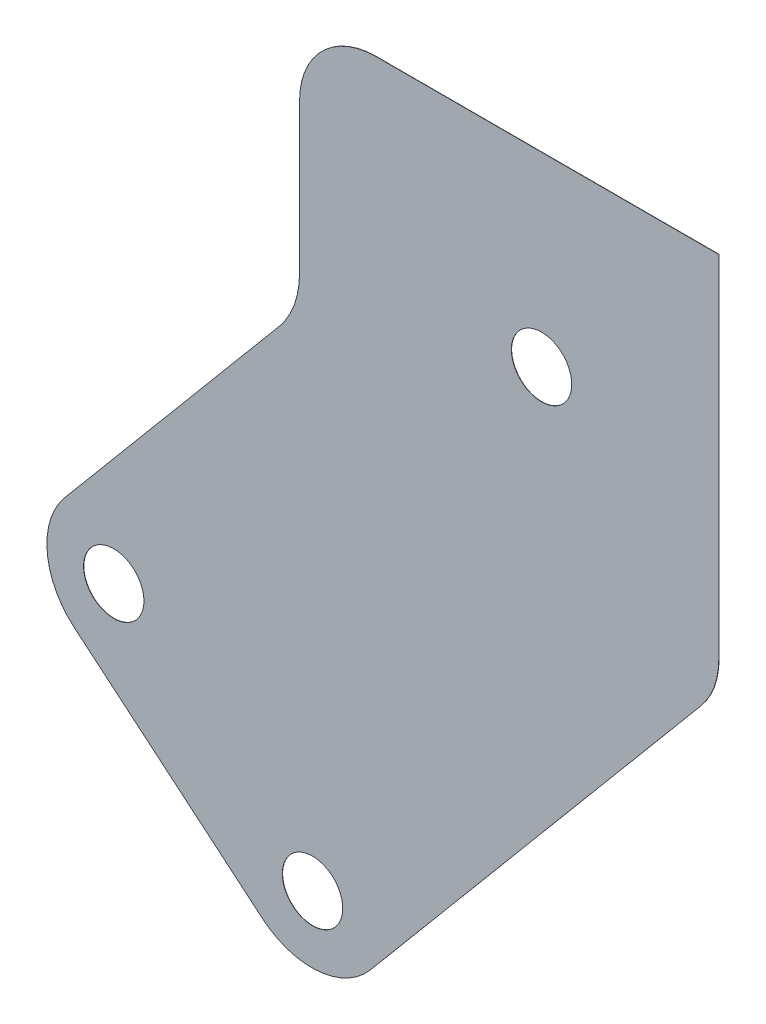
ISO-10303-21;
HEADER;
FILE_DESCRIPTION(('STEP AP214'),'2;1');
FILE_NAME('part.step','',(''),(''),'','','');
FILE_SCHEMA(('AUTOMOTIVE_DESIGN { 1 0 10303 214 1 1 1 1 }'));
ENDSEC;
DATA;
#1=APPLICATION_CONTEXT('core data for automotive mechanical design processes');
#2=APPLICATION_PROTOCOL_DEFINITION('international standard','automotive_design',2000,#1);
#3=PRODUCT_CONTEXT('',#1,'mechanical');
#4=PRODUCT('Part','Part','',(#3));
#5=PRODUCT_RELATED_PRODUCT_CATEGORY('part','',(#4));
#6=PRODUCT_DEFINITION_FORMATION('','',#4);
#7=PRODUCT_DEFINITION_CONTEXT('part definition',#1,'design');
#8=PRODUCT_DEFINITION('design','',#6,#7);
#9=PRODUCT_DEFINITION_SHAPE('','',#8);
#10=(LENGTH_UNIT() NAMED_UNIT(*) SI_UNIT(.MILLI.,.METRE.));
#11=(NAMED_UNIT(*) PLANE_ANGLE_UNIT() SI_UNIT($,.RADIAN.));
#12=(NAMED_UNIT(*) SI_UNIT($,.STERADIAN.) SOLID_ANGLE_UNIT());
#13=UNCERTAINTY_MEASURE_WITH_UNIT(LENGTH_MEASURE(1.E-05),#10,'distance_accuracy_value','');
#14=(GEOMETRIC_REPRESENTATION_CONTEXT(3) GLOBAL_UNCERTAINTY_ASSIGNED_CONTEXT((#13)) GLOBAL_UNIT_ASSIGNED_CONTEXT((#10,
#11,#12)) REPRESENTATION_CONTEXT('',''));
#15=CARTESIAN_POINT('',(0.,0.,0.));
#16=DIRECTION('',(0.,0.,1.));
#17=DIRECTION('',(1.,0.,0.));
#18=AXIS2_PLACEMENT_3D('',#15,#16,#17);
#19=CARTESIAN_POINT('',(-545.839152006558,-46.319640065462,0.0254000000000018));
#20=DIRECTION('',(-1.,0.,0.));
#21=DIRECTION('',(0.,0.,1.));
#22=AXIS2_PLACEMENT_3D('',#19,#20,#21);
#23=PLANE('',#22);
#24=DIRECTION('',(0.,1.,0.));
#25=VECTOR('',#24,1.);
#26=CARTESIAN_POINT('',(-545.839152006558,-46.319640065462,0.));
#27=LINE('',#26,#25);
#28=CARTESIAN_POINT('',(-545.839152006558,-46.319640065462,0.));
#29=VERTEX_POINT('',#28);
#30=CARTESIAN_POINT('',(-545.839152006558,-13.7078728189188,0.));
#31=VERTEX_POINT('',#30);
#32=EDGE_CURVE('E165',#29,#31,#27,.T.);
#33=ORIENTED_EDGE('',*,*,#32,.T.);
#34=DIRECTION('',(0.,0.,-1.));
#35=VECTOR('',#34,1.);
#36=CARTESIAN_POINT('',(-545.839152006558,-13.7078728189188,0.0254000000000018));
#37=LINE('',#36,#35);
#38=CARTESIAN_POINT('',(-545.839152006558,-13.7078728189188,0.0254000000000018));
#39=VERTEX_POINT('',#38);
#40=EDGE_CURVE('E11',#39,#31,#37,.T.);
#41=ORIENTED_EDGE('',*,*,#40,.F.);
#42=DIRECTION('',(0.,1.,0.));
#43=VECTOR('',#42,1.);
#44=CARTESIAN_POINT('',(-545.839152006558,-46.319640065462,0.0254000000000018));
#45=LINE('',#44,#43);
#46=CARTESIAN_POINT('',(-545.839152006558,-46.319640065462,0.0254000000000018));
#47=VERTEX_POINT('',#46);
#48=EDGE_CURVE('E197',#47,#39,#45,.T.);
#49=ORIENTED_EDGE('',*,*,#48,.F.);
#50=DIRECTION('',(0.,0.,-1.));
#51=VECTOR('',#50,1.);
#52=CARTESIAN_POINT('',(-545.839152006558,-46.319640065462,0.0254000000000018));
#53=LINE('',#52,#51);
#54=EDGE_CURVE('E161',#47,#29,#53,.T.);
#55=ORIENTED_EDGE('',*,*,#54,.T.);
#56=EDGE_LOOP('',(#33,#41,#49,#55));
#57=FACE_BOUND('',#56,.T.);
#58=ADVANCED_FACE('F45',(#57),#23,.F.);
#59=CARTESIAN_POINT('',(-545.839152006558,-13.7078728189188,0.0254000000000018));
#60=DIRECTION('',(0.,-1.,0.));
#61=DIRECTION('',(1.,0.,0.));
#62=AXIS2_PLACEMENT_3D('',#59,#60,#61);
#63=PLANE('',#62);
#64=DIRECTION('',(-1.,0.,0.));
#65=VECTOR('',#64,1.);
#66=CARTESIAN_POINT('',(-545.839152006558,-13.7078728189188,0.));
#67=LINE('',#66,#65);
#68=CARTESIAN_POINT('',(-577.716152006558,-13.7078728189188,0.));
#69=VERTEX_POINT('',#68);
#70=EDGE_CURVE('E169',#31,#69,#67,.T.);
#71=ORIENTED_EDGE('',*,*,#70,.T.);
#72=DIRECTION('',(0.,0.,-1.));
#73=VECTOR('',#72,1.);
#74=CARTESIAN_POINT('',(-577.716152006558,-13.7078728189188,0.0254000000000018));
#75=LINE('',#74,#73);
#76=CARTESIAN_POINT('',(-577.716152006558,-13.7078728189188,0.0254000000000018));
#77=VERTEX_POINT('',#76);
#78=EDGE_CURVE('E54',#77,#69,#75,.T.);
#79=ORIENTED_EDGE('',*,*,#78,.F.);
#80=DIRECTION('',(-1.,0.,0.));
#81=VECTOR('',#80,1.);
#82=CARTESIAN_POINT('',(-545.839152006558,-13.7078728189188,0.0254000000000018));
#83=LINE('',#82,#81);
#84=EDGE_CURVE('E114',#39,#77,#83,.T.);
#85=ORIENTED_EDGE('',*,*,#84,.F.);
#86=ORIENTED_EDGE('',*,*,#40,.T.);
#87=EDGE_LOOP('',(#71,#79,#85,#86));
#88=FACE_BOUND('',#87,.T.);
#89=ADVANCED_FACE('F290',(#88),#63,.F.);
#90=CARTESIAN_POINT('',(-577.716152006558,-20.8198728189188,0.0254000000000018));
#91=DIRECTION('',(0.,0.,-1.));
#92=DIRECTION('',(-1.,0.,0.));
#93=AXIS2_PLACEMENT_3D('',#90,#91,#92);
#94=CYLINDRICAL_SURFACE('',#93,7.112);
#95=CARTESIAN_POINT('',(-577.716152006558,-20.8198728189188,0.));
#96=DIRECTION('',(0.,0.,1.));
#97=DIRECTION('',(1.,0.,0.));
#98=AXIS2_PLACEMENT_3D('',#95,#96,#97);
#99=CIRCLE('',#98,7.112);
#100=CARTESIAN_POINT('',(-584.828152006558,-20.8198728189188,0.));
#101=VERTEX_POINT('',#100);
#102=EDGE_CURVE('E173',#69,#101,#99,.T.);
#103=ORIENTED_EDGE('',*,*,#102,.T.);
#104=DIRECTION('',(0.,0.,-1.));
#105=VECTOR('',#104,1.);
#106=CARTESIAN_POINT('',(-584.828152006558,-20.8198728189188,0.0254000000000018));
#107=LINE('',#106,#105);
#108=CARTESIAN_POINT('',(-584.828152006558,-20.8198728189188,0.0254000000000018));
#109=VERTEX_POINT('',#108);
#110=EDGE_CURVE('E220',#109,#101,#107,.T.);
#111=ORIENTED_EDGE('',*,*,#110,.F.);
#112=CARTESIAN_POINT('',(-577.716152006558,-20.8198728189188,0.0254000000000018));
#113=DIRECTION('',(0.,0.,1.));
#114=DIRECTION('',(1.,0.,0.));
#115=AXIS2_PLACEMENT_3D('',#112,#113,#114);
#116=CIRCLE('',#115,7.112);
#117=EDGE_CURVE('E231',#77,#109,#116,.T.);
#118=ORIENTED_EDGE('',*,*,#117,.F.);
#119=ORIENTED_EDGE('',*,*,#78,.T.);
#120=EDGE_LOOP('',(#103,#111,#118,#119));
#121=FACE_BOUND('',#120,.T.);
#122=ADVANCED_FACE('F229',(#121),#94,.T.);
#123=CARTESIAN_POINT('',(-584.828152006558,-20.8198728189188,0.0254000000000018));
#124=DIRECTION('',(1.,0.,0.));
#125=DIRECTION('',(0.,0.,-1.));
#126=AXIS2_PLACEMENT_3D('',#123,#124,#125);
#127=PLANE('',#126);
#128=DIRECTION('',(0.,-1.,0.));
#129=VECTOR('',#128,1.);
#130=CARTESIAN_POINT('',(-584.828152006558,-20.8198728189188,0.));
#131=LINE('',#130,#129);
#132=CARTESIAN_POINT('',(-584.828152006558,-34.722664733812,0.));
#133=VERTEX_POINT('',#132);
#134=EDGE_CURVE('E176',#101,#133,#131,.T.);
#135=ORIENTED_EDGE('',*,*,#134,.T.);
#136=DIRECTION('',(0.,0.,-1.));
#137=VECTOR('',#136,1.);
#138=CARTESIAN_POINT('',(-584.828152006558,-34.722664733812,0.0254000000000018));
#139=LINE('',#138,#137);
#140=CARTESIAN_POINT('',(-584.828152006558,-34.722664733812,0.0254000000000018));
#141=VERTEX_POINT('',#140);
#142=EDGE_CURVE('E216',#141,#133,#139,.T.);
#143=ORIENTED_EDGE('',*,*,#142,.F.);
#144=DIRECTION('',(0.,-1.,0.));
#145=VECTOR('',#144,1.);
#146=CARTESIAN_POINT('',(-584.828152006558,-20.8198728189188,0.0254000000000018));
#147=LINE('',#146,#145);
#148=EDGE_CURVE('E250',#109,#141,#147,.T.);
#149=ORIENTED_EDGE('',*,*,#148,.F.);
#150=ORIENTED_EDGE('',*,*,#110,.T.);
#151=EDGE_LOOP('',(#135,#143,#149,#150));
#152=FACE_BOUND('',#151,.T.);
#153=ADVANCED_FACE('F240',(#152),#127,.F.);
#154=CARTESIAN_POINT('',(-592.956152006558,-34.722664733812,0.0254000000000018));
#155=DIRECTION('',(0.,0.,-1.));
#156=DIRECTION('',(-1.,0.,0.));
#157=AXIS2_PLACEMENT_3D('',#154,#155,#156);
#158=CYLINDRICAL_SURFACE('',#157,8.12799999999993);
#159=CARTESIAN_POINT('',(-592.956152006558,-34.722664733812,0.));
#160=DIRECTION('',(0.,0.,-1.));
#161=DIRECTION('',(1.,0.,0.));
#162=AXIS2_PLACEMENT_3D('',#159,#160,#161);
#163=CIRCLE('',#162,8.12799999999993);
#164=CARTESIAN_POINT('',(-586.729742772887,-39.9472424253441,0.));
#165=VERTEX_POINT('',#164);
#166=EDGE_CURVE('E179',#133,#165,#163,.T.);
#167=ORIENTED_EDGE('',*,*,#166,.T.);
#168=DIRECTION('',(0.,0.,-1.));
#169=VECTOR('',#168,1.);
#170=CARTESIAN_POINT('',(-586.729742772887,-39.9472424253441,0.0254000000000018));
#171=LINE('',#170,#169);
#172=CARTESIAN_POINT('',(-586.729742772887,-39.9472424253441,0.0254000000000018));
#173=VERTEX_POINT('',#172);
#174=EDGE_CURVE('E212',#173,#165,#171,.T.);
#175=ORIENTED_EDGE('',*,*,#174,.F.);
#176=CARTESIAN_POINT('',(-592.956152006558,-34.722664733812,0.0254000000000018));
#177=DIRECTION('',(0.,0.,-1.));
#178=DIRECTION('',(1.,0.,0.));
#179=AXIS2_PLACEMENT_3D('',#176,#177,#178);
#180=CIRCLE('',#179,8.12799999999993);
#181=EDGE_CURVE('E246',#141,#173,#180,.T.);
#182=ORIENTED_EDGE('',*,*,#181,.F.);
#183=ORIENTED_EDGE('',*,*,#142,.T.);
#184=EDGE_LOOP('',(#167,#175,#182,#183));
#185=FACE_BOUND('',#184,.T.);
#186=ADVANCED_FACE('F244',(#185),#158,.F.);
#187=CARTESIAN_POINT('',(-586.729742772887,-39.9472424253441,0.0254000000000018));
#188=DIRECTION('',(0.76604444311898,-0.642787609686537,0.));
#189=DIRECTION('',(0.642787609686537,0.76604444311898,0.));
#190=AXIS2_PLACEMENT_3D('',#187,#188,#189);
#191=PLANE('',#190);
#192=DIRECTION('',(-0.642787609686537,-0.76604444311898,0.));
#193=VECTOR('',#192,1.);
#194=CARTESIAN_POINT('',(-586.729742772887,-39.9472424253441,0.));
#195=LINE('',#194,#193);
#196=CARTESIAN_POINT('',(-606.65926008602,-63.6983162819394,0.));
#197=VERTEX_POINT('',#196);
#198=EDGE_CURVE('E182',#165,#197,#195,.T.);
#199=ORIENTED_EDGE('',*,*,#198,.T.);
#200=DIRECTION('',(0.,0.,-1.));
#201=VECTOR('',#200,1.);
#202=CARTESIAN_POINT('',(-606.65926008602,-63.6983162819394,0.0254000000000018));
#203=LINE('',#202,#201);
#204=CARTESIAN_POINT('',(-606.65926008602,-63.6983162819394,0.0254000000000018));
#205=VERTEX_POINT('',#204);
#206=EDGE_CURVE('E208',#205,#197,#203,.T.);
#207=ORIENTED_EDGE('',*,*,#206,.F.);
#208=DIRECTION('',(-0.642787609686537,-0.76604444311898,0.));
#209=VECTOR('',#208,1.);
#210=CARTESIAN_POINT('',(-586.729742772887,-39.9472424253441,0.0254000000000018));
#211=LINE('',#210,#209);
#212=EDGE_CURVE('E249',#173,#205,#211,.T.);
#213=ORIENTED_EDGE('',*,*,#212,.F.);
#214=ORIENTED_EDGE('',*,*,#174,.T.);
#215=EDGE_LOOP('',(#199,#207,#213,#214));
#216=FACE_BOUND('',#215,.T.);
#217=ADVANCED_FACE('F303',(#216),#191,.F.);
#218=CARTESIAN_POINT('',(-601.211152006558,-68.26982176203,0.0254000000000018));
#219=DIRECTION('',(0.,0.,-1.));
#220=DIRECTION('',(-1.,0.,0.));
#221=AXIS2_PLACEMENT_3D('',#218,#219,#220);
#222=CYLINDRICAL_SURFACE('',#221,7.11200000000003);
#223=CARTESIAN_POINT('',(-601.211152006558,-68.26982176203,0.));
#224=DIRECTION('',(0.,0.,1.));
#225=DIRECTION('',(1.,0.,0.));
#226=AXIS2_PLACEMENT_3D('',#223,#224,#225);
#227=CIRCLE('',#226,7.11200000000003);
#228=CARTESIAN_POINT('',(-605.782657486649,-73.7179298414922,0.));
#229=VERTEX_POINT('',#228);
#230=EDGE_CURVE('E185',#197,#229,#227,.T.);
#231=ORIENTED_EDGE('',*,*,#230,.T.);
#232=DIRECTION('',(0.,0.,-1.));
#233=VECTOR('',#232,1.);
#234=CARTESIAN_POINT('',(-605.782657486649,-73.7179298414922,0.0254000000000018));
#235=LINE('',#234,#233);
#236=CARTESIAN_POINT('',(-605.782657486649,-73.7179298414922,0.0254000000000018));
#237=VERTEX_POINT('',#236);
#238=EDGE_CURVE('E204',#237,#229,#235,.T.);
#239=ORIENTED_EDGE('',*,*,#238,.F.);
#240=CARTESIAN_POINT('',(-601.211152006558,-68.26982176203,0.0254000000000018));
#241=DIRECTION('',(0.,0.,1.));
#242=DIRECTION('',(1.,0.,0.));
#243=AXIS2_PLACEMENT_3D('',#240,#241,#242);
#244=CIRCLE('',#243,7.11200000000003);
#245=EDGE_CURVE('E255',#205,#237,#244,.T.);
#246=ORIENTED_EDGE('',*,*,#245,.F.);
#247=ORIENTED_EDGE('',*,*,#206,.T.);
#248=EDGE_LOOP('',(#231,#239,#246,#247));
#249=FACE_BOUND('',#248,.T.);
#250=ADVANCED_FACE('F270',(#249),#222,.T.);
#251=CARTESIAN_POINT('',(-605.782657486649,-73.7179298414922,0.0254000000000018));
#252=DIRECTION('',(0.64278760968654,0.766044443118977,0.));
#253=DIRECTION('',(-0.766044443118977,0.64278760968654,0.));
#254=AXIS2_PLACEMENT_3D('',#251,#252,#253);
#255=PLANE('',#254);
#256=DIRECTION('',(0.766044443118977,-0.64278760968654,0.));
#257=VECTOR('',#256,1.);
#258=CARTESIAN_POINT('',(-605.782657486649,-73.7179298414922,0.));
#259=LINE('',#258,#257);
#260=CARTESIAN_POINT('',(-588.270881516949,-88.4120545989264,0.));
#261=VERTEX_POINT('',#260);
#262=EDGE_CURVE('E188',#229,#261,#259,.T.);
#263=ORIENTED_EDGE('',*,*,#262,.T.);
#264=DIRECTION('',(0.,0.,-1.));
#265=VECTOR('',#264,1.);
#266=CARTESIAN_POINT('',(-588.270881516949,-88.4120545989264,0.0254000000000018));
#267=LINE('',#266,#265);
#268=CARTESIAN_POINT('',(-588.270881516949,-88.4120545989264,0.0254000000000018));
#269=VERTEX_POINT('',#268);
#270=EDGE_CURVE('E153',#269,#261,#267,.T.);
#271=ORIENTED_EDGE('',*,*,#270,.F.);
#272=DIRECTION('',(0.766044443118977,-0.64278760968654,0.));
#273=VECTOR('',#272,1.);
#274=CARTESIAN_POINT('',(-605.782657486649,-73.7179298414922,0.0254000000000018));
#275=LINE('',#274,#273);
#276=EDGE_CURVE('E142',#237,#269,#275,.T.);
#277=ORIENTED_EDGE('',*,*,#276,.F.);
#278=ORIENTED_EDGE('',*,*,#238,.T.);
#279=EDGE_LOOP('',(#263,#271,#277,#278));
#280=FACE_BOUND('',#279,.T.);
#281=ADVANCED_FACE('F274',(#280),#255,.F.);
#282=CARTESIAN_POINT('',(-583.699376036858,-82.9639465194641,0.0254000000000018));
#283=DIRECTION('',(0.,0.,-1.));
#284=DIRECTION('',(-1.,0.,0.));
#285=AXIS2_PLACEMENT_3D('',#282,#283,#284);
#286=CYLINDRICAL_SURFACE('',#285,7.11200000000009);
#287=CARTESIAN_POINT('',(-583.699376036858,-82.9639465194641,0.));
#288=DIRECTION('',(0.,0.,1.));
#289=DIRECTION('',(1.,0.,0.));
#290=AXIS2_PLACEMENT_3D('',#287,#288,#289);
#291=CIRCLE('',#290,7.11200000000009);
#292=CARTESIAN_POINT('',(-578.251267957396,-87.5354519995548,0.));
#293=VERTEX_POINT('',#292);
#294=EDGE_CURVE('E151',#261,#293,#291,.T.);
#295=ORIENTED_EDGE('',*,*,#294,.T.);
#296=DIRECTION('',(0.,0.,-1.));
#297=VECTOR('',#296,1.);
#298=CARTESIAN_POINT('',(-578.251267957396,-87.5354519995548,0.0254000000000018));
#299=LINE('',#298,#297);
#300=CARTESIAN_POINT('',(-578.251267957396,-87.5354519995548,0.0254000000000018));
#301=VERTEX_POINT('',#300);
#302=EDGE_CURVE('E148',#301,#293,#299,.T.);
#303=ORIENTED_EDGE('',*,*,#302,.F.);
#304=CARTESIAN_POINT('',(-583.699376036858,-82.9639465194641,0.0254000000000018));
#305=DIRECTION('',(0.,0.,1.));
#306=DIRECTION('',(1.,0.,0.));
#307=AXIS2_PLACEMENT_3D('',#304,#305,#306);
#308=CIRCLE('',#307,7.11200000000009);
#309=EDGE_CURVE('E136',#269,#301,#308,.T.);
#310=ORIENTED_EDGE('',*,*,#309,.F.);
#311=ORIENTED_EDGE('',*,*,#270,.T.);
#312=EDGE_LOOP('',(#295,#303,#310,#311));
#313=FACE_BOUND('',#312,.T.);
#314=ADVANCED_FACE('F149',(#313),#286,.T.);
#315=CARTESIAN_POINT('',(-578.251267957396,-87.5354519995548,0.0254000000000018));
#316=DIRECTION('',(-0.766044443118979,0.642787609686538,0.));
#317=DIRECTION('',(-0.642787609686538,-0.766044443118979,0.));
#318=AXIS2_PLACEMENT_3D('',#315,#316,#317);
#319=PLANE('',#318);
#320=DIRECTION('',(0.642787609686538,0.766044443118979,0.));
#321=VECTOR('',#320,1.);
#322=CARTESIAN_POINT('',(-578.251267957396,-87.5354519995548,0.));
#323=LINE('',#322,#321);
#324=CARTESIAN_POINT('',(-547.503043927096,-50.8911455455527,0.));
#325=VERTEX_POINT('',#324);
#326=EDGE_CURVE('E100',#293,#325,#323,.T.);
#327=ORIENTED_EDGE('',*,*,#326,.T.);
#328=DIRECTION('',(0.,0.,-1.));
#329=VECTOR('',#328,1.);
#330=CARTESIAN_POINT('',(-547.503043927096,-50.8911455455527,0.0254000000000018));
#331=LINE('',#330,#329);
#332=CARTESIAN_POINT('',(-547.503043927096,-50.8911455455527,0.0254000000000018));
#333=VERTEX_POINT('',#332);
#334=EDGE_CURVE('E154',#333,#325,#331,.T.);
#335=ORIENTED_EDGE('',*,*,#334,.F.);
#336=DIRECTION('',(0.642787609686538,0.766044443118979,0.));
#337=VECTOR('',#336,1.);
#338=CARTESIAN_POINT('',(-578.251267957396,-87.5354519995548,0.0254000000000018));
#339=LINE('',#338,#337);
#340=EDGE_CURVE('E140',#301,#333,#339,.T.);
#341=ORIENTED_EDGE('',*,*,#340,.F.);
#342=ORIENTED_EDGE('',*,*,#302,.T.);
#343=EDGE_LOOP('',(#327,#335,#341,#342));
#344=FACE_BOUND('',#343,.T.);
#345=ADVANCED_FACE('F156',(#344),#319,.F.);
#346=CARTESIAN_POINT('',(-552.951152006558,-46.319640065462,0.0254000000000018));
#347=DIRECTION('',(0.,0.,-1.));
#348=DIRECTION('',(-1.,0.,0.));
#349=AXIS2_PLACEMENT_3D('',#346,#347,#348);
#350=CYLINDRICAL_SURFACE('',#349,7.11199999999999);
#351=CARTESIAN_POINT('',(-552.951152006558,-46.319640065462,0.));
#352=DIRECTION('',(0.,0.,1.));
#353=DIRECTION('',(1.,0.,0.));
#354=AXIS2_PLACEMENT_3D('',#351,#352,#353);
#355=CIRCLE('',#354,7.11199999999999);
#356=EDGE_CURVE('E106',#325,#29,#355,.T.);
#357=ORIENTED_EDGE('',*,*,#356,.T.);
#358=ORIENTED_EDGE('',*,*,#54,.F.);
#359=CARTESIAN_POINT('',(-552.951152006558,-46.319640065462,0.0254000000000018));
#360=DIRECTION('',(0.,0.,1.));
#361=DIRECTION('',(1.,0.,0.));
#362=AXIS2_PLACEMENT_3D('',#359,#360,#361);
#363=CIRCLE('',#362,7.11199999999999);
#364=EDGE_CURVE('E62',#333,#47,#363,.T.);
#365=ORIENTED_EDGE('',*,*,#364,.F.);
#366=ORIENTED_EDGE('',*,*,#334,.T.);
#367=EDGE_LOOP('',(#357,#358,#365,#366));
#368=FACE_BOUND('',#367,.T.);
#369=ADVANCED_FACE('F278',(#368),#350,.T.);
#370=CARTESIAN_POINT('',(-577.716152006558,-20.8198728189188,0.0254000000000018));
#371=DIRECTION('',(0.,0.,1.));
#372=DIRECTION('',(1.,0.,0.));
#373=AXIS2_PLACEMENT_3D('',#370,#371,#372);
#374=PLANE('',#373);
#375=CARTESIAN_POINT('',(-602.1057603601,-68.3480898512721,0.0254000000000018));
#376=DIRECTION('',(0.,0.,1.));
#377=DIRECTION('',(1.,0.,0.));
#378=AXIS2_PLACEMENT_3D('',#375,#376,#377);
#379=CIRCLE('',#378,2.80670000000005);
#380=CARTESIAN_POINT('',(-599.2990603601,-68.3480898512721,0.0254000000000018));
#381=VERTEX_POINT('',#380);
#382=EDGE_CURVE('E385',#381,#381,#379,.T.);
#383=ORIENTED_EDGE('',*,*,#382,.F.);
#384=EDGE_LOOP('',(#383));
#385=FACE_BOUND('',#384,.T.);
#386=CARTESIAN_POINT('',(-583.621107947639,-83.8585548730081,0.0254000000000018));
#387=DIRECTION('',(0.,0.,1.));
#388=DIRECTION('',(1.,0.,0.));
#389=AXIS2_PLACEMENT_3D('',#386,#387,#388);
#390=CIRCLE('',#389,2.80670000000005);
#391=CARTESIAN_POINT('',(-580.814407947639,-83.8585548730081,0.0254000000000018));
#392=VERTEX_POINT('',#391);
#393=EDGE_CURVE('E393',#392,#392,#390,.T.);
#394=ORIENTED_EDGE('',*,*,#393,.F.);
#395=EDGE_LOOP('',(#394));
#396=FACE_BOUND('',#395,.T.);
#397=CARTESIAN_POINT('',(-562.323795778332,-31.0085922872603,0.0254000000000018));
#398=DIRECTION('',(0.,0.,1.));
#399=DIRECTION('',(1.,0.,0.));
#400=AXIS2_PLACEMENT_3D('',#397,#398,#399);
#401=CIRCLE('',#400,2.80670000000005);
#402=CARTESIAN_POINT('',(-559.517095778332,-31.0085922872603,0.0254000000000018));
#403=VERTEX_POINT('',#402);
#404=EDGE_CURVE('E170',#403,#403,#401,.T.);
#405=ORIENTED_EDGE('',*,*,#404,.F.);
#406=EDGE_LOOP('',(#405));
#407=FACE_BOUND('',#406,.T.);
#408=ORIENTED_EDGE('',*,*,#48,.T.);
#409=ORIENTED_EDGE('',*,*,#84,.T.);
#410=ORIENTED_EDGE('',*,*,#117,.T.);
#411=ORIENTED_EDGE('',*,*,#148,.T.);
#412=ORIENTED_EDGE('',*,*,#181,.T.);
#413=ORIENTED_EDGE('',*,*,#212,.T.);
#414=ORIENTED_EDGE('',*,*,#245,.T.);
#415=ORIENTED_EDGE('',*,*,#276,.T.);
#416=ORIENTED_EDGE('',*,*,#309,.T.);
#417=ORIENTED_EDGE('',*,*,#340,.T.);
#418=ORIENTED_EDGE('',*,*,#364,.T.);
#419=EDGE_LOOP('',(#408,#409,#410,#411,#412,#413,#414,#415,#416,#417,#418));
#420=FACE_BOUND('',#419,.T.);
#421=ADVANCED_FACE('F138',(#385,#396,#407,#420),#374,.T.);
#422=CARTESIAN_POINT('',(-577.716152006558,-20.8198728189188,0.));
#423=DIRECTION('',(0.,0.,1.));
#424=DIRECTION('',(1.,0.,0.));
#425=AXIS2_PLACEMENT_3D('',#422,#423,#424);
#426=PLANE('',#425);
#427=CARTESIAN_POINT('',(-602.1057603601,-68.3480898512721,0.));
#428=DIRECTION('',(0.,0.,1.));
#429=DIRECTION('',(1.,0.,0.));
#430=AXIS2_PLACEMENT_3D('',#427,#428,#429);
#431=CIRCLE('',#430,2.80670000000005);
#432=CARTESIAN_POINT('',(-599.2990603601,-68.3480898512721,0.));
#433=VERTEX_POINT('',#432);
#434=EDGE_CURVE('E382',#433,#433,#431,.T.);
#435=ORIENTED_EDGE('',*,*,#434,.T.);
#436=EDGE_LOOP('',(#435));
#437=FACE_BOUND('',#436,.T.);
#438=CARTESIAN_POINT('',(-583.621107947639,-83.8585548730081,0.));
#439=DIRECTION('',(0.,0.,1.));
#440=DIRECTION('',(1.,0.,0.));
#441=AXIS2_PLACEMENT_3D('',#438,#439,#440);
#442=CIRCLE('',#441,2.80670000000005);
#443=CARTESIAN_POINT('',(-580.814407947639,-83.8585548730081,0.));
#444=VERTEX_POINT('',#443);
#445=EDGE_CURVE('E387',#444,#444,#442,.T.);
#446=ORIENTED_EDGE('',*,*,#445,.T.);
#447=EDGE_LOOP('',(#446));
#448=FACE_BOUND('',#447,.T.);
#449=CARTESIAN_POINT('',(-562.323795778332,-31.0085922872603,0.));
#450=DIRECTION('',(0.,0.,1.));
#451=DIRECTION('',(1.,0.,0.));
#452=AXIS2_PLACEMENT_3D('',#449,#450,#451);
#453=CIRCLE('',#452,2.80670000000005);
#454=CARTESIAN_POINT('',(-559.517095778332,-31.0085922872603,0.));
#455=VERTEX_POINT('',#454);
#456=EDGE_CURVE('E400',#455,#455,#453,.T.);
#457=ORIENTED_EDGE('',*,*,#456,.T.);
#458=EDGE_LOOP('',(#457));
#459=FACE_BOUND('',#458,.T.);
#460=ORIENTED_EDGE('',*,*,#32,.F.);
#461=ORIENTED_EDGE('',*,*,#356,.F.);
#462=ORIENTED_EDGE('',*,*,#326,.F.);
#463=ORIENTED_EDGE('',*,*,#294,.F.);
#464=ORIENTED_EDGE('',*,*,#262,.F.);
#465=ORIENTED_EDGE('',*,*,#230,.F.);
#466=ORIENTED_EDGE('',*,*,#198,.F.);
#467=ORIENTED_EDGE('',*,*,#166,.F.);
#468=ORIENTED_EDGE('',*,*,#134,.F.);
#469=ORIENTED_EDGE('',*,*,#102,.F.);
#470=ORIENTED_EDGE('',*,*,#70,.F.);
#471=EDGE_LOOP('',(#460,#461,#462,#463,#464,#465,#466,#467,#468,#469,#470));
#472=FACE_BOUND('',#471,.T.);
#473=ADVANCED_FACE('F235',(#437,#448,#459,#472),#426,.F.);
#474=CARTESIAN_POINT('',(-562.323795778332,-31.0085922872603,0.0254000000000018));
#475=DIRECTION('',(0.,0.,1.));
#476=DIRECTION('',(1.,0.,0.));
#477=AXIS2_PLACEMENT_3D('',#474,#475,#476);
#478=CYLINDRICAL_SURFACE('',#477,2.80670000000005);
#479=ORIENTED_EDGE('',*,*,#456,.F.);
#480=EDGE_LOOP('',(#479));
#481=FACE_BOUND('',#480,.T.);
#482=ORIENTED_EDGE('',*,*,#404,.T.);
#483=EDGE_LOOP('',(#482));
#484=FACE_BOUND('',#483,.T.);
#485=ADVANCED_FACE('F341',(#481,#484),#478,.F.);
#486=CARTESIAN_POINT('',(-583.621107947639,-83.8585548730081,0.0254000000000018));
#487=DIRECTION('',(0.,0.,1.));
#488=DIRECTION('',(1.,0.,0.));
#489=AXIS2_PLACEMENT_3D('',#486,#487,#488);
#490=CYLINDRICAL_SURFACE('',#489,2.80670000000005);
#491=ORIENTED_EDGE('',*,*,#445,.F.);
#492=EDGE_LOOP('',(#491));
#493=FACE_BOUND('',#492,.T.);
#494=ORIENTED_EDGE('',*,*,#393,.T.);
#495=EDGE_LOOP('',(#494));
#496=FACE_BOUND('',#495,.T.);
#497=ADVANCED_FACE('F351',(#493,#496),#490,.F.);
#498=CARTESIAN_POINT('',(-602.1057603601,-68.3480898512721,0.0254000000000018));
#499=DIRECTION('',(0.,0.,1.));
#500=DIRECTION('',(1.,0.,0.));
#501=AXIS2_PLACEMENT_3D('',#498,#499,#500);
#502=CYLINDRICAL_SURFACE('',#501,2.80670000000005);
#503=ORIENTED_EDGE('',*,*,#434,.F.);
#504=EDGE_LOOP('',(#503));
#505=FACE_BOUND('',#504,.T.);
#506=ORIENTED_EDGE('',*,*,#382,.T.);
#507=EDGE_LOOP('',(#506));
#508=FACE_BOUND('',#507,.T.);
#509=ADVANCED_FACE('F362',(#505,#508),#502,.F.);
#510=CLOSED_SHELL('',(#58,#89,#122,#153,#186,#217,#250,#281,#314,#345,#369,#421,#473,#485,#497,#509));
#511=MANIFOLD_SOLID_BREP('B2',#510);
#512=ADVANCED_BREP_SHAPE_REPRESENTATION('',(#18,#511),#14);
#513=SHAPE_DEFINITION_REPRESENTATION(#9,#512);
ENDSEC;
END-ISO-10303-21;
